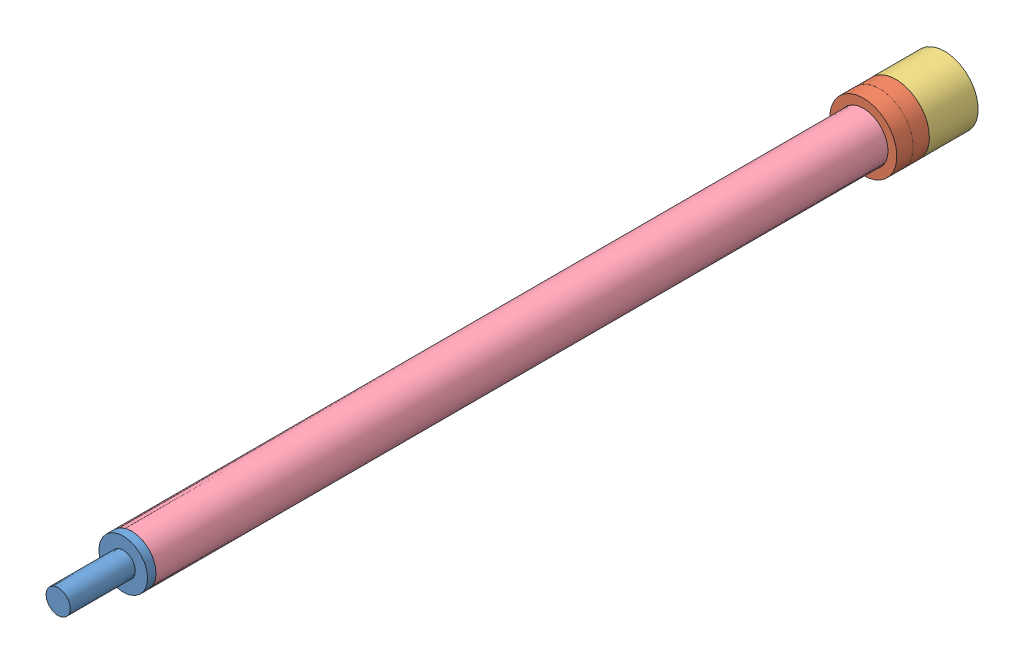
SolidWorks assembly Internal_&.SLDASM, configuration Default (file format 8000). Lengths in mm.
Overall size (35.68 35.68 346.2).
5 component instances, 4 part files, 8 mates.
Components (placement in the parent):
- small_threaded_end_&-1: small_threaded_end_&.SLDPRT [Default] at (0 0 143.51) x (-0.224009 0.974587 0) z (0 0 1) size (19.05 19.05 43.94)
- thin_collar_&-1: thin_collar_&.SLDPRT [Default] at (0 0 -133.35) size (26.21 26.21 6.35)
- thin_collar_&-2: thin_collar_&.SLDPRT [Default] at (0 0 -139.7) x (0.872319 -0.488937 0) z (0 0 1) size (26.21 26.21 6.35)
- small collar_&-1: small collar_&.SLDPRT [Default] at (0 0 -158.75) size (26.21 26.21 19.05)
- small center_tube_&-1: small center_tube_&.SLDPRT [Default] at origin size (19.05 19.05 317.5)
Mates (geometry in assembly coordinates):
- Concentric1: concentric aligned: cylinder of small_threaded_end_&-1 through (0 0 158.75) axis (0 0 -1) radius 8.509; cylinder of small center_tube_&-1 through (0 0 158.75) axis (0 0 -1) radius 8.636
- Coincident1: coincident anti-aligned: plane of small_threaded_end_&-1 through (0 0 158.75) normal (0 0 -1); plane of small center_tube_&-1 through (0 0 158.75) normal (0 0 1)
- Concentric2: concentric aligned: cylinder of small collar_&-1 through (0 0 -139.7) axis (0 0 -1) radius 9.652; cylinder of small center_tube_&-1 through (0 0 158.75) axis (0 0 -1) radius 9.525
- Coincident2: coincident aligned: plane of small collar_&-1 through (0 0 -158.75) normal (0 0 -1); plane of small center_tube_&-1 through (0 0 -158.75) normal (0 0 -1)
- Concentric3: concentric aligned: cylinder of thin_collar_&-2 through (0 0 -133.35) axis (0 0 -1) radius 9.6647; cylinder of small center_tube_&-1 through (0 0 158.75) axis (0 0 -1) radius 9.525
- Coincident3: coincident anti-aligned: plane of thin_collar_&-2 through (0 0 -139.7) normal (0 0 -1); plane of small collar_&-1 through (0 0 -139.7) normal (0 0 1)
- Coincident4: coincident anti-aligned: plane of thin_collar_&-1 through (0 0 -133.35) normal (0 0 -1); plane of thin_collar_&-2 through (0 0 -133.35) normal (0 0 1)
- Concentric4: concentric aligned: cylinder of thin_collar_&-1 through (0 0 -127) axis (0 0 -1) radius 9.6647; cylinder of small center_tube_&-1 through (0 0 158.75) axis (0 0 -1) radius 9.525
